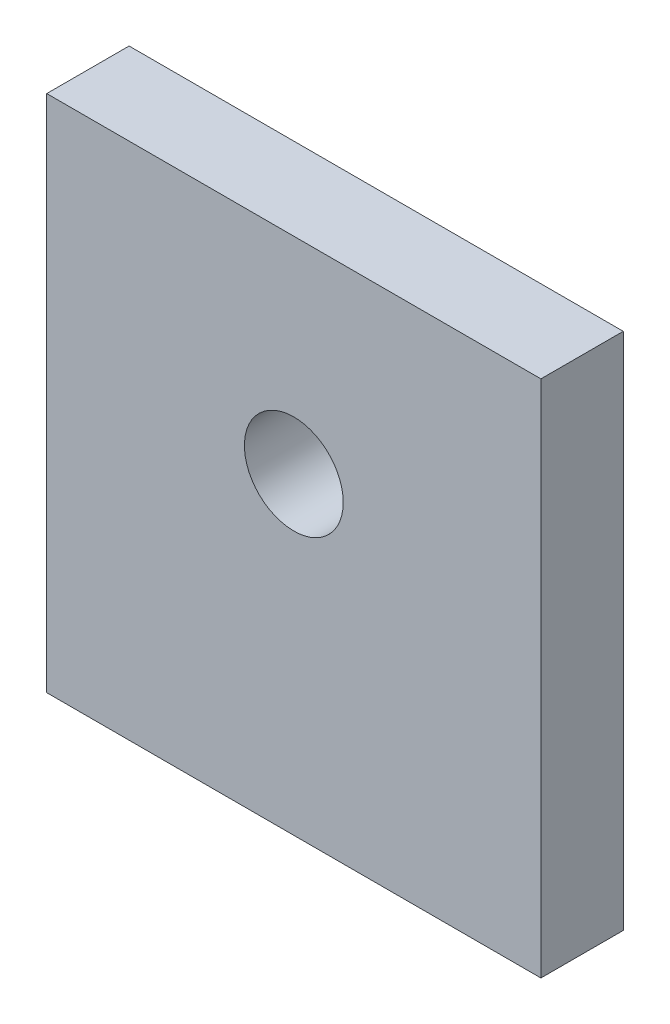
from build123d import *

# Parameters (mm, degrees)
SKETCH1_W           = 60
SKETCH1_H           = 63
SKETCH1_R           = 6
BOSS_EXTRUDE1_DEPTH = 10


with BuildPart() as part:
    # Sketch1 → Boss-Extrude1 (new body)
    with BuildSketch(Plane.XY):
        Rectangle(SKETCH1_W, SKETCH1_H)
        with Locations((0, 6.5)):
            Circle(SKETCH1_R, mode=Mode.SUBTRACT)
    extrude(amount=BOSS_EXTRUDE1_DEPTH)


solid = part.part
